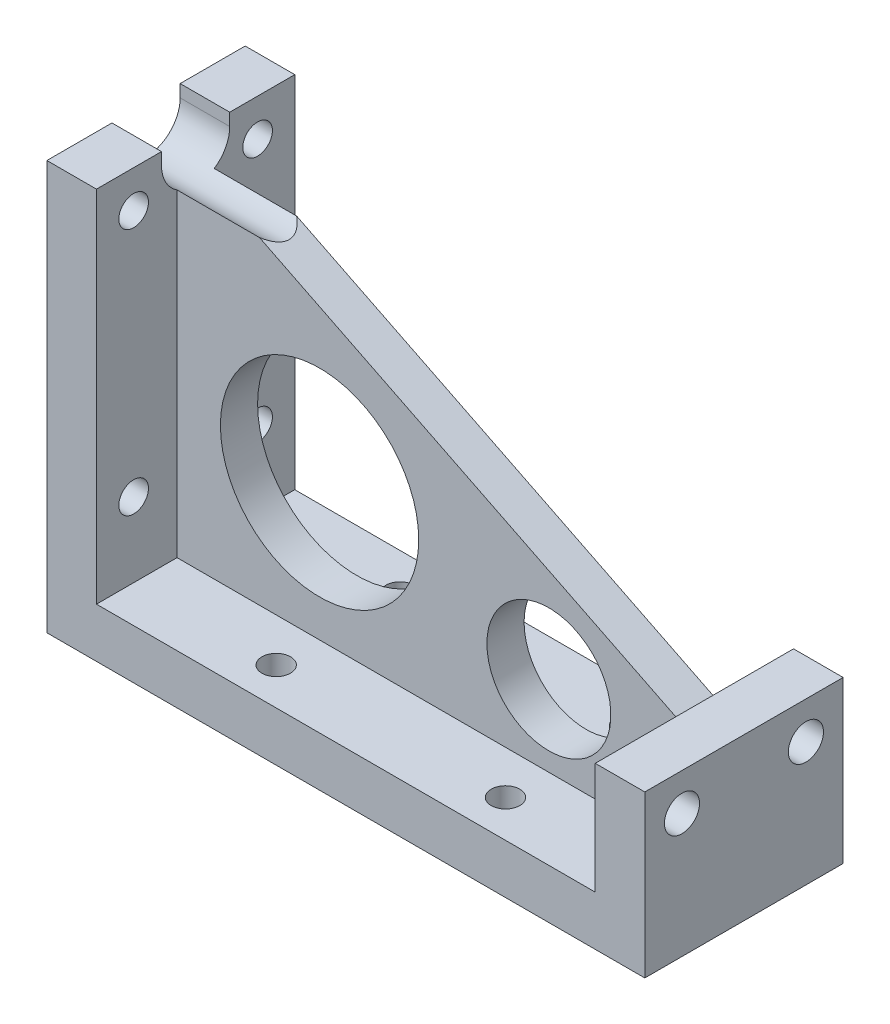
ISO-10303-21;
HEADER;
FILE_DESCRIPTION(('STEP AP214'),'2;1');
FILE_NAME('part.step','',(''),(''),'','','');
FILE_SCHEMA(('AUTOMOTIVE_DESIGN { 1 0 10303 214 1 1 1 1 }'));
ENDSEC;
DATA;
#1=APPLICATION_CONTEXT('core data for automotive mechanical design processes');
#2=APPLICATION_PROTOCOL_DEFINITION('international standard','automotive_design',2000,#1);
#3=PRODUCT_CONTEXT('',#1,'mechanical');
#4=PRODUCT('Part','Part','',(#3));
#5=PRODUCT_RELATED_PRODUCT_CATEGORY('part','',(#4));
#6=PRODUCT_DEFINITION_FORMATION('','',#4);
#7=PRODUCT_DEFINITION_CONTEXT('part definition',#1,'design');
#8=PRODUCT_DEFINITION('design','',#6,#7);
#9=PRODUCT_DEFINITION_SHAPE('','',#8);
#10=(LENGTH_UNIT() NAMED_UNIT(*) SI_UNIT(.MILLI.,.METRE.));
#11=(NAMED_UNIT(*) PLANE_ANGLE_UNIT() SI_UNIT($,.RADIAN.));
#12=(NAMED_UNIT(*) SI_UNIT($,.STERADIAN.) SOLID_ANGLE_UNIT());
#13=UNCERTAINTY_MEASURE_WITH_UNIT(LENGTH_MEASURE(1.E-05),#10,'distance_accuracy_value','');
#14=(GEOMETRIC_REPRESENTATION_CONTEXT(3) GLOBAL_UNCERTAINTY_ASSIGNED_CONTEXT((#13)) GLOBAL_UNIT_ASSIGNED_CONTEXT((#10,
#11,#12)) REPRESENTATION_CONTEXT('',''));
#15=CARTESIAN_POINT('',(0.,0.,0.));
#16=DIRECTION('',(0.,0.,1.));
#17=DIRECTION('',(1.,0.,0.));
#18=AXIS2_PLACEMENT_3D('',#15,#16,#17);
#19=CARTESIAN_POINT('',(0.,52.3875,12.7));
#20=DIRECTION('',(0.,-1.,0.));
#21=DIRECTION('',(0.,0.,-1.));
#22=AXIS2_PLACEMENT_3D('',#19,#20,#21);
#23=PLANE('',#22);
#24=DIRECTION('',(0.,0.,-1.));
#25=VECTOR('',#24,1.);
#26=CARTESIAN_POINT('',(0.,52.3875,12.7));
#27=LINE('',#26,#25);
#28=CARTESIAN_POINT('',(0.,52.3875,-4.3688));
#29=VERTEX_POINT('',#28);
#30=CARTESIAN_POINT('',(0.,52.3875,-12.7));
#31=VERTEX_POINT('',#30);
#32=EDGE_CURVE('E203',#29,#31,#27,.T.);
#33=ORIENTED_EDGE('',*,*,#32,.F.);
#34=DIRECTION('',(-1.,0.,0.));
#35=VECTOR('',#34,1.);
#36=CARTESIAN_POINT('',(76.581,52.3875,-4.3688));
#37=LINE('',#36,#35);
#38=CARTESIAN_POINT('',(6.35000000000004,52.3875,-4.3688));
#39=VERTEX_POINT('',#38);
#40=EDGE_CURVE('E382',#39,#29,#37,.T.);
#41=ORIENTED_EDGE('',*,*,#40,.F.);
#42=DIRECTION('',(0.,0.,-1.));
#43=VECTOR('',#42,1.);
#44=CARTESIAN_POINT('',(6.35,52.3875,12.7));
#45=LINE('',#44,#43);
#46=CARTESIAN_POINT('',(6.35,52.3875,-12.7));
#47=VERTEX_POINT('',#46);
#48=EDGE_CURVE('E98',#39,#47,#45,.T.);
#49=ORIENTED_EDGE('',*,*,#48,.T.);
#50=DIRECTION('',(-1.,0.,0.));
#51=VECTOR('',#50,1.);
#52=CARTESIAN_POINT('',(0.,52.3875,-12.7));
#53=LINE('',#52,#51);
#54=EDGE_CURVE('E161',#47,#31,#53,.T.);
#55=ORIENTED_EDGE('',*,*,#54,.T.);
#56=EDGE_LOOP('',(#33,#41,#49,#55));
#57=FACE_BOUND('',#56,.T.);
#58=ADVANCED_FACE('F40',(#57),#23,.F.);
#59=CARTESIAN_POINT('',(70.231,20.6375,12.7));
#60=DIRECTION('',(1.,0.,0.));
#61=DIRECTION('',(0.,0.,-1.));
#62=AXIS2_PLACEMENT_3D('',#59,#60,#61);
#63=PLANE('',#62);
#64=CARTESIAN_POINT('',(70.231,15.875,7.93750000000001));
#65=DIRECTION('',(1.,0.,0.));
#66=DIRECTION('',(0.,0.,-1.));
#67=AXIS2_PLACEMENT_3D('',#64,#65,#66);
#68=CIRCLE('',#67,2.2479);
#69=CARTESIAN_POINT('',(70.231,15.875,5.68960000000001));
#70=VERTEX_POINT('',#69);
#71=EDGE_CURVE('E269',#70,#70,#68,.T.);
#72=ORIENTED_EDGE('',*,*,#71,.T.);
#73=EDGE_LOOP('',(#72));
#74=FACE_BOUND('',#73,.T.);
#75=DIRECTION('',(0.,1.,0.));
#76=VECTOR('',#75,1.);
#77=CARTESIAN_POINT('',(70.231,6.35,2.38125));
#78=LINE('',#77,#76);
#79=CARTESIAN_POINT('',(70.231,6.35,2.38125));
#80=VERTEX_POINT('',#79);
#81=CARTESIAN_POINT('',(70.231,20.6375,2.38125));
#82=VERTEX_POINT('',#81);
#83=EDGE_CURVE('E144',#80,#82,#78,.T.);
#84=ORIENTED_EDGE('',*,*,#83,.F.);
#85=DIRECTION('',(0.,0.,-1.));
#86=VECTOR('',#85,1.);
#87=CARTESIAN_POINT('',(70.231,6.35,12.7));
#88=LINE('',#87,#86);
#89=CARTESIAN_POINT('',(70.231,6.35,12.7));
#90=VERTEX_POINT('',#89);
#91=EDGE_CURVE('E140',#90,#80,#88,.T.);
#92=ORIENTED_EDGE('',*,*,#91,.F.);
#93=DIRECTION('',(0.,-1.,0.));
#94=VECTOR('',#93,1.);
#95=CARTESIAN_POINT('',(70.231,20.6375,12.7));
#96=LINE('',#95,#94);
#97=CARTESIAN_POINT('',(70.231,20.6375,12.7));
#98=VERTEX_POINT('',#97);
#99=EDGE_CURVE('E125',#98,#90,#96,.T.);
#100=ORIENTED_EDGE('',*,*,#99,.F.);
#101=DIRECTION('',(0.,0.,-1.));
#102=VECTOR('',#101,1.);
#103=CARTESIAN_POINT('',(70.231,20.6375,12.7));
#104=LINE('',#103,#102);
#105=EDGE_CURVE('E190',#98,#82,#104,.T.);
#106=ORIENTED_EDGE('',*,*,#105,.T.);
#107=EDGE_LOOP('',(#84,#92,#100,#106));
#108=FACE_BOUND('',#107,.T.);
#109=ADVANCED_FACE('F141',(#74,#108),#63,.F.);
#110=CARTESIAN_POINT('',(6.35000000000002,6.34999999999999,12.7));
#111=DIRECTION('',(0.,-1.,0.));
#112=DIRECTION('',(1.,0.,0.));
#113=AXIS2_PLACEMENT_3D('',#110,#111,#112);
#114=PLANE('',#113);
#115=CARTESIAN_POINT('',(53.975,6.35,7.9375));
#116=DIRECTION('',(0.,1.,0.));
#117=DIRECTION('',(0.,0.,1.));
#118=AXIS2_PLACEMENT_3D('',#115,#116,#117);
#119=CIRCLE('',#118,1.82879999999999);
#120=CARTESIAN_POINT('',(53.975,6.35,9.76629999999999));
#121=VERTEX_POINT('',#120);
#122=EDGE_CURVE('E423',#121,#121,#119,.T.);
#123=ORIENTED_EDGE('',*,*,#122,.F.);
#124=EDGE_LOOP('',(#123));
#125=FACE_BOUND('',#124,.T.);
#126=CARTESIAN_POINT('',(24.60625,6.35,7.9375));
#127=DIRECTION('',(0.,1.,0.));
#128=DIRECTION('',(0.,0.,1.));
#129=AXIS2_PLACEMENT_3D('',#126,#127,#128);
#130=CIRCLE('',#129,1.82879999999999);
#131=CARTESIAN_POINT('',(24.60625,6.35,9.76629999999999));
#132=VERTEX_POINT('',#131);
#133=EDGE_CURVE('E417',#132,#132,#130,.T.);
#134=ORIENTED_EDGE('',*,*,#133,.F.);
#135=EDGE_LOOP('',(#134));
#136=FACE_BOUND('',#135,.T.);
#137=DIRECTION('',(1.,0.,0.));
#138=VECTOR('',#137,1.);
#139=CARTESIAN_POINT('',(53.975,6.35,2.38125));
#140=LINE('',#139,#138);
#141=CARTESIAN_POINT('',(6.35000000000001,6.34999999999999,2.38125));
#142=VERTEX_POINT('',#141);
#143=EDGE_CURVE('E235',#142,#80,#140,.T.);
#144=ORIENTED_EDGE('',*,*,#143,.F.);
#145=DIRECTION('',(0.,0.,-1.));
#146=VECTOR('',#145,1.);
#147=CARTESIAN_POINT('',(6.35000000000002,6.34999999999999,12.7));
#148=LINE('',#147,#146);
#149=CARTESIAN_POINT('',(6.35000000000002,6.34999999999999,12.7));
#150=VERTEX_POINT('',#149);
#151=EDGE_CURVE('E152',#150,#142,#148,.T.);
#152=ORIENTED_EDGE('',*,*,#151,.F.);
#153=DIRECTION('',(-1.,0.,0.));
#154=VECTOR('',#153,1.);
#155=CARTESIAN_POINT('',(53.975,6.35,12.7));
#156=LINE('',#155,#154);
#157=EDGE_CURVE('E129',#90,#150,#156,.T.);
#158=ORIENTED_EDGE('',*,*,#157,.F.);
#159=ORIENTED_EDGE('',*,*,#91,.T.);
#160=EDGE_LOOP('',(#144,#152,#158,#159));
#161=FACE_BOUND('',#160,.T.);
#162=ADVANCED_FACE('F150',(#125,#136,#161),#114,.F.);
#163=CARTESIAN_POINT('',(6.35,52.3875,12.7));
#164=DIRECTION('',(-1.,0.,0.));
#165=DIRECTION('',(0.,-1.,0.));
#166=AXIS2_PLACEMENT_3D('',#163,#164,#165);
#167=PLANE('',#166);
#168=CARTESIAN_POINT('',(6.35000000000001,47.625,7.93750000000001));
#169=DIRECTION('',(1.,0.,0.));
#170=DIRECTION('',(0.,0.,-1.));
#171=AXIS2_PLACEMENT_3D('',#168,#169,#170);
#172=CIRCLE('',#171,1.89865);
#173=CARTESIAN_POINT('',(6.35000000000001,47.625,6.03885000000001));
#174=VERTEX_POINT('',#173);
#175=EDGE_CURVE('E275',#174,#174,#172,.T.);
#176=ORIENTED_EDGE('',*,*,#175,.F.);
#177=EDGE_LOOP('',(#176));
#178=FACE_BOUND('',#177,.T.);
#179=CARTESIAN_POINT('',(6.35000000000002,15.875,7.93750000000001));
#180=DIRECTION('',(1.,0.,0.));
#181=DIRECTION('',(0.,0.,-1.));
#182=AXIS2_PLACEMENT_3D('',#179,#180,#181);
#183=CIRCLE('',#182,1.89865);
#184=CARTESIAN_POINT('',(6.35000000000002,15.875,6.03885000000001));
#185=VERTEX_POINT('',#184);
#186=EDGE_CURVE('E208',#185,#185,#183,.T.);
#187=ORIENTED_EDGE('',*,*,#186,.F.);
#188=EDGE_LOOP('',(#187));
#189=FACE_BOUND('',#188,.T.);
#190=CARTESIAN_POINT('',(6.35000000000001,50.8,0.));
#191=DIRECTION('',(-1.,0.,0.));
#192=DIRECTION('',(0.,-1.,0.));
#193=AXIS2_PLACEMENT_3D('',#190,#191,#192);
#194=CIRCLE('',#193,4.3688);
#195=CARTESIAN_POINT('',(6.35000000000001,47.1372057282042,2.38125));
#196=VERTEX_POINT('',#195);
#197=CARTESIAN_POINT('',(6.35000000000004,50.8,4.3688));
#198=VERTEX_POINT('',#197);
#199=EDGE_CURVE('E368',#196,#198,#194,.T.);
#200=ORIENTED_EDGE('',*,*,#199,.T.);
#201=DIRECTION('',(0.,1.,0.));
#202=VECTOR('',#201,1.);
#203=CARTESIAN_POINT('',(6.35,52.3875,4.3688));
#204=LINE('',#203,#202);
#205=CARTESIAN_POINT('',(6.35000000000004,52.3875,4.3688));
#206=VERTEX_POINT('',#205);
#207=EDGE_CURVE('E366',#198,#206,#204,.T.);
#208=ORIENTED_EDGE('',*,*,#207,.T.);
#209=CARTESIAN_POINT('',(6.35,52.3875,12.7));
#210=VERTEX_POINT('',#209);
#211=EDGE_CURVE('E185',#210,#206,#45,.T.);
#212=ORIENTED_EDGE('',*,*,#211,.F.);
#213=DIRECTION('',(0.,1.,0.));
#214=VECTOR('',#213,1.);
#215=CARTESIAN_POINT('',(6.35,52.3875,12.7));
#216=LINE('',#215,#214);
#217=EDGE_CURVE('E64',#150,#210,#216,.T.);
#218=ORIENTED_EDGE('',*,*,#217,.F.);
#219=ORIENTED_EDGE('',*,*,#151,.T.);
#220=DIRECTION('',(0.,-1.,0.));
#221=VECTOR('',#220,1.);
#222=CARTESIAN_POINT('',(6.35000000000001,6.34999999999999,2.38125));
#223=LINE('',#222,#221);
#224=EDGE_CURVE('E231',#196,#142,#223,.T.);
#225=ORIENTED_EDGE('',*,*,#224,.F.);
#226=EDGE_LOOP('',(#200,#208,#212,#218,#219,#225));
#227=FACE_BOUND('',#226,.T.);
#228=ADVANCED_FACE('F342',(#178,#189,#227),#167,.F.);
#229=ORIENTED_EDGE('',*,*,#211,.T.);
#230=DIRECTION('',(-1.,0.,0.));
#231=VECTOR('',#230,1.);
#232=CARTESIAN_POINT('',(76.581,52.3875,4.3688));
#233=LINE('',#232,#231);
#234=CARTESIAN_POINT('',(0.,52.3875,4.3688));
#235=VERTEX_POINT('',#234);
#236=EDGE_CURVE('E359',#206,#235,#233,.T.);
#237=ORIENTED_EDGE('',*,*,#236,.T.);
#238=CARTESIAN_POINT('',(0.,52.3875,12.7));
#239=VERTEX_POINT('',#238);
#240=EDGE_CURVE('E204',#239,#235,#27,.T.);
#241=ORIENTED_EDGE('',*,*,#240,.F.);
#242=DIRECTION('',(-1.,0.,0.));
#243=VECTOR('',#242,1.);
#244=CARTESIAN_POINT('',(0.,52.3875,12.7));
#245=LINE('',#244,#243);
#246=EDGE_CURVE('E184',#210,#239,#245,.T.);
#247=ORIENTED_EDGE('',*,*,#246,.F.);
#248=EDGE_LOOP('',(#229,#237,#241,#247));
#249=FACE_BOUND('',#248,.T.);
#250=ADVANCED_FACE('F42',(#249),#23,.F.);
#251=CARTESIAN_POINT('',(0.,52.3875,12.7));
#252=DIRECTION('',(1.,0.,0.));
#253=DIRECTION('',(0.,1.,0.));
#254=AXIS2_PLACEMENT_3D('',#251,#252,#253);
#255=PLANE('',#254);
#256=CARTESIAN_POINT('',(0.,47.625,7.93750000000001));
#257=DIRECTION('',(1.,0.,0.));
#258=DIRECTION('',(0.,1.,0.));
#259=AXIS2_PLACEMENT_3D('',#256,#257,#258);
#260=CIRCLE('',#259,1.89865);
#261=CARTESIAN_POINT('',(0.,49.52365,7.93750000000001));
#262=VERTEX_POINT('',#261);
#263=EDGE_CURVE('E284',#262,#262,#260,.T.);
#264=ORIENTED_EDGE('',*,*,#263,.T.);
#265=EDGE_LOOP('',(#264));
#266=FACE_BOUND('',#265,.T.);
#267=CARTESIAN_POINT('',(0.,47.625,-7.93749999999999));
#268=DIRECTION('',(1.,0.,0.));
#269=DIRECTION('',(0.,1.,0.));
#270=AXIS2_PLACEMENT_3D('',#267,#268,#269);
#271=CIRCLE('',#270,1.89865);
#272=CARTESIAN_POINT('',(0.,49.52365,-7.93749999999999));
#273=VERTEX_POINT('',#272);
#274=EDGE_CURVE('E290',#273,#273,#271,.T.);
#275=ORIENTED_EDGE('',*,*,#274,.T.);
#276=EDGE_LOOP('',(#275));
#277=FACE_BOUND('',#276,.T.);
#278=CARTESIAN_POINT('',(0.,15.875,-7.93749999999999));
#279=DIRECTION('',(1.,0.,0.));
#280=DIRECTION('',(0.,1.,0.));
#281=AXIS2_PLACEMENT_3D('',#278,#279,#280);
#282=CIRCLE('',#281,1.89865);
#283=CARTESIAN_POINT('',(0.,17.77365,-7.93749999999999));
#284=VERTEX_POINT('',#283);
#285=EDGE_CURVE('E206',#284,#284,#282,.T.);
#286=ORIENTED_EDGE('',*,*,#285,.T.);
#287=EDGE_LOOP('',(#286));
#288=FACE_BOUND('',#287,.T.);
#289=CARTESIAN_POINT('',(0.,15.875,7.93750000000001));
#290=DIRECTION('',(1.,0.,0.));
#291=DIRECTION('',(0.,1.,0.));
#292=AXIS2_PLACEMENT_3D('',#289,#290,#291);
#293=CIRCLE('',#292,1.89865);
#294=CARTESIAN_POINT('',(0.,17.77365,7.93750000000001));
#295=VERTEX_POINT('',#294);
#296=EDGE_CURVE('E298',#295,#295,#293,.T.);
#297=ORIENTED_EDGE('',*,*,#296,.T.);
#298=EDGE_LOOP('',(#297));
#299=FACE_BOUND('',#298,.T.);
#300=CARTESIAN_POINT('',(0.,50.8,0.));
#301=DIRECTION('',(-1.,0.,0.));
#302=DIRECTION('',(0.,1.,0.));
#303=AXIS2_PLACEMENT_3D('',#300,#301,#302);
#304=CIRCLE('',#303,4.3688);
#305=CARTESIAN_POINT('',(0.,50.8,-4.3688));
#306=VERTEX_POINT('',#305);
#307=CARTESIAN_POINT('',(0.,50.8,4.3688));
#308=VERTEX_POINT('',#307);
#309=EDGE_CURVE('E394',#306,#308,#304,.T.);
#310=ORIENTED_EDGE('',*,*,#309,.F.);
#311=DIRECTION('',(0.,-1.,0.));
#312=VECTOR('',#311,1.);
#313=CARTESIAN_POINT('',(0.,52.3875,-4.3688));
#314=LINE('',#313,#312);
#315=EDGE_CURVE('E397',#29,#306,#314,.T.);
#316=ORIENTED_EDGE('',*,*,#315,.F.);
#317=ORIENTED_EDGE('',*,*,#32,.T.);
#318=DIRECTION('',(0.,-1.,0.));
#319=VECTOR('',#318,1.);
#320=CARTESIAN_POINT('',(0.,52.3875,-12.7));
#321=LINE('',#320,#319);
#322=CARTESIAN_POINT('',(0.,0.,-12.7));
#323=VERTEX_POINT('',#322);
#324=EDGE_CURVE('E163',#31,#323,#321,.T.);
#325=ORIENTED_EDGE('',*,*,#324,.T.);
#326=DIRECTION('',(0.,0.,-1.));
#327=VECTOR('',#326,1.);
#328=CARTESIAN_POINT('',(0.,0.,12.7));
#329=LINE('',#328,#327);
#330=CARTESIAN_POINT('',(0.,0.,12.7));
#331=VERTEX_POINT('',#330);
#332=EDGE_CURVE('E200',#331,#323,#329,.T.);
#333=ORIENTED_EDGE('',*,*,#332,.F.);
#334=DIRECTION('',(0.,-1.,0.));
#335=VECTOR('',#334,1.);
#336=CARTESIAN_POINT('',(0.,52.3875,12.7));
#337=LINE('',#336,#335);
#338=EDGE_CURVE('E107',#239,#331,#337,.T.);
#339=ORIENTED_EDGE('',*,*,#338,.F.);
#340=ORIENTED_EDGE('',*,*,#240,.T.);
#341=DIRECTION('',(0.,1.,0.));
#342=VECTOR('',#341,1.);
#343=CARTESIAN_POINT('',(0.,52.3875,4.3688));
#344=LINE('',#343,#342);
#345=EDGE_CURVE('E387',#308,#235,#344,.T.);
#346=ORIENTED_EDGE('',*,*,#345,.F.);
#347=EDGE_LOOP('',(#310,#316,#317,#325,#333,#339,#340,#346));
#348=FACE_BOUND('',#347,.T.);
#349=ADVANCED_FACE('F341',(#266,#277,#288,#299,#348),#255,.F.);
#350=CARTESIAN_POINT('',(53.975,0.,12.7));
#351=DIRECTION('',(0.,1.,0.));
#352=DIRECTION('',(-1.,0.,0.));
#353=AXIS2_PLACEMENT_3D('',#350,#351,#352);
#354=PLANE('',#353);
#355=CARTESIAN_POINT('',(53.975,0.,7.9375));
#356=DIRECTION('',(0.,1.,0.));
#357=DIRECTION('',(0.,0.,1.));
#358=AXIS2_PLACEMENT_3D('',#355,#356,#357);
#359=CIRCLE('',#358,1.8288);
#360=CARTESIAN_POINT('',(53.975,0.,9.7663));
#361=VERTEX_POINT('',#360);
#362=EDGE_CURVE('E420',#361,#361,#359,.T.);
#363=ORIENTED_EDGE('',*,*,#362,.T.);
#364=EDGE_LOOP('',(#363));
#365=FACE_BOUND('',#364,.T.);
#366=CARTESIAN_POINT('',(24.60625,0.,7.9375));
#367=DIRECTION('',(0.,1.,0.));
#368=DIRECTION('',(0.,0.,1.));
#369=AXIS2_PLACEMENT_3D('',#366,#367,#368);
#370=CIRCLE('',#369,1.8288);
#371=CARTESIAN_POINT('',(24.60625,0.,9.7663));
#372=VERTEX_POINT('',#371);
#373=EDGE_CURVE('E414',#372,#372,#370,.T.);
#374=ORIENTED_EDGE('',*,*,#373,.T.);
#375=EDGE_LOOP('',(#374));
#376=FACE_BOUND('',#375,.T.);
#377=CARTESIAN_POINT('',(24.60625,0.,-7.9375));
#378=DIRECTION('',(0.,1.,0.));
#379=DIRECTION('',(0.,0.,1.));
#380=AXIS2_PLACEMENT_3D('',#377,#378,#379);
#381=CIRCLE('',#380,1.8288);
#382=CARTESIAN_POINT('',(24.60625,0.,-6.1087));
#383=VERTEX_POINT('',#382);
#384=EDGE_CURVE('E408',#383,#383,#381,.T.);
#385=ORIENTED_EDGE('',*,*,#384,.T.);
#386=EDGE_LOOP('',(#385));
#387=FACE_BOUND('',#386,.T.);
#388=CARTESIAN_POINT('',(53.975,0.,-7.9375));
#389=DIRECTION('',(0.,1.,0.));
#390=DIRECTION('',(0.,0.,1.));
#391=AXIS2_PLACEMENT_3D('',#388,#389,#390);
#392=CIRCLE('',#391,1.8288);
#393=CARTESIAN_POINT('',(53.975,0.,-6.1087));
#394=VERTEX_POINT('',#393);
#395=EDGE_CURVE('E400',#394,#394,#392,.T.);
#396=ORIENTED_EDGE('',*,*,#395,.T.);
#397=EDGE_LOOP('',(#396));
#398=FACE_BOUND('',#397,.T.);
#399=DIRECTION('',(1.,0.,0.));
#400=VECTOR('',#399,1.);
#401=CARTESIAN_POINT('',(53.975,0.,-12.7));
#402=LINE('',#401,#400);
#403=CARTESIAN_POINT('',(76.581,0.,-12.7));
#404=VERTEX_POINT('',#403);
#405=EDGE_CURVE('E167',#323,#404,#402,.T.);
#406=ORIENTED_EDGE('',*,*,#405,.T.);
#407=DIRECTION('',(0.,0.,-1.));
#408=VECTOR('',#407,1.);
#409=CARTESIAN_POINT('',(76.581,0.,12.7));
#410=LINE('',#409,#408);
#411=CARTESIAN_POINT('',(76.581,0.,12.7));
#412=VERTEX_POINT('',#411);
#413=EDGE_CURVE('E197',#412,#404,#410,.T.);
#414=ORIENTED_EDGE('',*,*,#413,.F.);
#415=DIRECTION('',(1.,0.,0.));
#416=VECTOR('',#415,1.);
#417=CARTESIAN_POINT('',(0.,0.,12.7));
#418=LINE('',#417,#416);
#419=EDGE_CURVE('E260',#331,#412,#418,.T.);
#420=ORIENTED_EDGE('',*,*,#419,.F.);
#421=ORIENTED_EDGE('',*,*,#332,.T.);
#422=EDGE_LOOP('',(#406,#414,#420,#421));
#423=FACE_BOUND('',#422,.T.);
#424=ADVANCED_FACE('F348',(#365,#376,#387,#398,#423),#354,.F.);
#425=CARTESIAN_POINT('',(76.581,20.6375,12.7));
#426=DIRECTION('',(-1.,0.,0.));
#427=DIRECTION('',(0.,0.,1.));
#428=AXIS2_PLACEMENT_3D('',#425,#426,#427);
#429=PLANE('',#428);
#430=CARTESIAN_POINT('',(76.581,15.875,-7.93749999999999));
#431=DIRECTION('',(1.,0.,0.));
#432=DIRECTION('',(0.,0.,-1.));
#433=AXIS2_PLACEMENT_3D('',#430,#431,#432);
#434=CIRCLE('',#433,2.2479);
#435=CARTESIAN_POINT('',(76.581,15.875,-10.1854));
#436=VERTEX_POINT('',#435);
#437=EDGE_CURVE('E278',#436,#436,#434,.T.);
#438=ORIENTED_EDGE('',*,*,#437,.F.);
#439=EDGE_LOOP('',(#438));
#440=FACE_BOUND('',#439,.T.);
#441=CARTESIAN_POINT('',(76.581,15.875,7.93750000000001));
#442=DIRECTION('',(1.,0.,0.));
#443=DIRECTION('',(0.,0.,-1.));
#444=AXIS2_PLACEMENT_3D('',#441,#442,#443);
#445=CIRCLE('',#444,2.2479);
#446=CARTESIAN_POINT('',(76.581,15.875,5.68960000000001));
#447=VERTEX_POINT('',#446);
#448=EDGE_CURVE('E267',#447,#447,#445,.T.);
#449=ORIENTED_EDGE('',*,*,#448,.F.);
#450=EDGE_LOOP('',(#449));
#451=FACE_BOUND('',#450,.T.);
#452=DIRECTION('',(0.,1.,0.));
#453=VECTOR('',#452,1.);
#454=CARTESIAN_POINT('',(76.581,20.6375,-12.7));
#455=LINE('',#454,#453);
#456=CARTESIAN_POINT('',(76.581,20.6375,-12.7));
#457=VERTEX_POINT('',#456);
#458=EDGE_CURVE('E170',#404,#457,#455,.T.);
#459=ORIENTED_EDGE('',*,*,#458,.T.);
#460=DIRECTION('',(0.,0.,-1.));
#461=VECTOR('',#460,1.);
#462=CARTESIAN_POINT('',(76.581,20.6375,12.7));
#463=LINE('',#462,#461);
#464=CARTESIAN_POINT('',(76.581,20.6375,12.7));
#465=VERTEX_POINT('',#464);
#466=EDGE_CURVE('E193',#465,#457,#463,.T.);
#467=ORIENTED_EDGE('',*,*,#466,.F.);
#468=DIRECTION('',(0.,1.,0.));
#469=VECTOR('',#468,1.);
#470=CARTESIAN_POINT('',(76.581,20.6375,12.7));
#471=LINE('',#470,#469);
#472=EDGE_CURVE('E262',#412,#465,#471,.T.);
#473=ORIENTED_EDGE('',*,*,#472,.F.);
#474=ORIENTED_EDGE('',*,*,#413,.T.);
#475=EDGE_LOOP('',(#459,#467,#473,#474));
#476=FACE_BOUND('',#475,.T.);
#477=ADVANCED_FACE('F548',(#440,#451,#476),#429,.F.);
#478=CARTESIAN_POINT('',(76.581,20.6375,12.7));
#479=DIRECTION('',(0.,-1.,0.));
#480=DIRECTION('',(0.,0.,-1.));
#481=AXIS2_PLACEMENT_3D('',#478,#479,#480);
#482=PLANE('',#481);
#483=DIRECTION('',(-1.,0.,0.));
#484=VECTOR('',#483,1.);
#485=CARTESIAN_POINT('',(76.581,20.6375,-12.7));
#486=LINE('',#485,#484);
#487=CARTESIAN_POINT('',(70.231,20.6375,-12.7));
#488=VERTEX_POINT('',#487);
#489=EDGE_CURVE('E172',#457,#488,#486,.T.);
#490=ORIENTED_EDGE('',*,*,#489,.T.);
#491=CARTESIAN_POINT('',(70.231,20.6375,-2.38125));
#492=VERTEX_POINT('',#491);
#493=EDGE_CURVE('E147',#492,#488,#104,.T.);
#494=ORIENTED_EDGE('',*,*,#493,.F.);
#495=DIRECTION('',(0.,0.,-1.));
#496=VECTOR('',#495,1.);
#497=CARTESIAN_POINT('',(70.231,20.6375,2.38125));
#498=LINE('',#497,#496);
#499=EDGE_CURVE('E164',#82,#492,#498,.T.);
#500=ORIENTED_EDGE('',*,*,#499,.F.);
#501=ORIENTED_EDGE('',*,*,#105,.F.);
#502=DIRECTION('',(-1.,0.,0.));
#503=VECTOR('',#502,1.);
#504=CARTESIAN_POINT('',(76.581,20.6375,12.7));
#505=LINE('',#504,#503);
#506=EDGE_CURVE('E132',#465,#98,#505,.T.);
#507=ORIENTED_EDGE('',*,*,#506,.F.);
#508=ORIENTED_EDGE('',*,*,#466,.T.);
#509=EDGE_LOOP('',(#490,#494,#500,#501,#507,#508));
#510=FACE_BOUND('',#509,.T.);
#511=ADVANCED_FACE('F529',(#510),#482,.F.);
#512=CARTESIAN_POINT('',(70.231,15.875,-7.93749999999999));
#513=DIRECTION('',(1.,0.,0.));
#514=DIRECTION('',(0.,0.,-1.));
#515=AXIS2_PLACEMENT_3D('',#512,#513,#514);
#516=CIRCLE('',#515,2.2479);
#517=CARTESIAN_POINT('',(70.231,15.875,-10.1854));
#518=VERTEX_POINT('',#517);
#519=EDGE_CURVE('E270',#518,#518,#516,.T.);
#520=ORIENTED_EDGE('',*,*,#519,.T.);
#521=EDGE_LOOP('',(#520));
#522=FACE_BOUND('',#521,.T.);
#523=CARTESIAN_POINT('',(70.231,6.35,-2.38125));
#524=VERTEX_POINT('',#523);
#525=CARTESIAN_POINT('',(70.231,6.35,-12.7));
#526=VERTEX_POINT('',#525);
#527=EDGE_CURVE('E148',#524,#526,#88,.T.);
#528=ORIENTED_EDGE('',*,*,#527,.F.);
#529=DIRECTION('',(0.,1.,0.));
#530=VECTOR('',#529,1.);
#531=CARTESIAN_POINT('',(70.231,6.35,-2.38125));
#532=LINE('',#531,#530);
#533=EDGE_CURVE('E232',#524,#492,#532,.T.);
#534=ORIENTED_EDGE('',*,*,#533,.T.);
#535=ORIENTED_EDGE('',*,*,#493,.T.);
#536=DIRECTION('',(0.,-1.,0.));
#537=VECTOR('',#536,1.);
#538=CARTESIAN_POINT('',(70.231,20.6375,-12.7));
#539=LINE('',#538,#537);
#540=EDGE_CURVE('E175',#488,#526,#539,.T.);
#541=ORIENTED_EDGE('',*,*,#540,.T.);
#542=EDGE_LOOP('',(#528,#534,#535,#541));
#543=FACE_BOUND('',#542,.T.);
#544=ADVANCED_FACE('F338',(#522,#543),#63,.F.);
#545=CARTESIAN_POINT('',(24.60625,6.35,-7.9375));
#546=DIRECTION('',(0.,1.,0.));
#547=DIRECTION('',(0.,0.,1.));
#548=AXIS2_PLACEMENT_3D('',#545,#546,#547);
#549=CIRCLE('',#548,1.82879999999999);
#550=CARTESIAN_POINT('',(24.60625,6.35,-6.10870000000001));
#551=VERTEX_POINT('',#550);
#552=EDGE_CURVE('E411',#551,#551,#549,.T.);
#553=ORIENTED_EDGE('',*,*,#552,.F.);
#554=EDGE_LOOP('',(#553));
#555=FACE_BOUND('',#554,.T.);
#556=CARTESIAN_POINT('',(53.975,6.35,-7.9375));
#557=DIRECTION('',(0.,1.,0.));
#558=DIRECTION('',(0.,0.,1.));
#559=AXIS2_PLACEMENT_3D('',#556,#557,#558);
#560=CIRCLE('',#559,1.82879999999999);
#561=CARTESIAN_POINT('',(53.975,6.35,-6.10870000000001));
#562=VERTEX_POINT('',#561);
#563=EDGE_CURVE('E404',#562,#562,#560,.T.);
#564=ORIENTED_EDGE('',*,*,#563,.F.);
#565=EDGE_LOOP('',(#564));
#566=FACE_BOUND('',#565,.T.);
#567=CARTESIAN_POINT('',(6.35000000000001,6.34999999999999,-2.38125));
#568=VERTEX_POINT('',#567);
#569=CARTESIAN_POINT('',(6.35000000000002,6.34999999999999,-12.7));
#570=VERTEX_POINT('',#569);
#571=EDGE_CURVE('E188',#568,#570,#148,.T.);
#572=ORIENTED_EDGE('',*,*,#571,.F.);
#573=DIRECTION('',(1.,0.,0.));
#574=VECTOR('',#573,1.);
#575=CARTESIAN_POINT('',(53.975,6.35,-2.38125));
#576=LINE('',#575,#574);
#577=EDGE_CURVE('E238',#568,#524,#576,.T.);
#578=ORIENTED_EDGE('',*,*,#577,.T.);
#579=ORIENTED_EDGE('',*,*,#527,.T.);
#580=DIRECTION('',(-1.,0.,0.));
#581=VECTOR('',#580,1.);
#582=CARTESIAN_POINT('',(6.35000000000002,6.34999999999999,-12.7));
#583=LINE('',#582,#581);
#584=EDGE_CURVE('E178',#526,#570,#583,.T.);
#585=ORIENTED_EDGE('',*,*,#584,.T.);
#586=EDGE_LOOP('',(#572,#578,#579,#585));
#587=FACE_BOUND('',#586,.T.);
#588=ADVANCED_FACE('F433',(#555,#566,#587),#114,.F.);
#589=CARTESIAN_POINT('',(6.35000000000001,47.625,-7.93749999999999));
#590=DIRECTION('',(1.,0.,0.));
#591=DIRECTION('',(0.,0.,-1.));
#592=AXIS2_PLACEMENT_3D('',#589,#590,#591);
#593=CIRCLE('',#592,1.89865);
#594=CARTESIAN_POINT('',(6.35000000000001,47.625,-9.83614999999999));
#595=VERTEX_POINT('',#594);
#596=EDGE_CURVE('E287',#595,#595,#593,.T.);
#597=ORIENTED_EDGE('',*,*,#596,.F.);
#598=EDGE_LOOP('',(#597));
#599=FACE_BOUND('',#598,.T.);
#600=CARTESIAN_POINT('',(6.35000000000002,15.875,-7.93749999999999));
#601=DIRECTION('',(1.,0.,0.));
#602=DIRECTION('',(0.,0.,-1.));
#603=AXIS2_PLACEMENT_3D('',#600,#601,#602);
#604=CIRCLE('',#603,1.89865);
#605=CARTESIAN_POINT('',(6.35000000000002,15.875,-9.83614999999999));
#606=VERTEX_POINT('',#605);
#607=EDGE_CURVE('E209',#606,#606,#604,.T.);
#608=ORIENTED_EDGE('',*,*,#607,.F.);
#609=EDGE_LOOP('',(#608));
#610=FACE_BOUND('',#609,.T.);
#611=ORIENTED_EDGE('',*,*,#48,.F.);
#612=DIRECTION('',(0.,-1.,0.));
#613=VECTOR('',#612,1.);
#614=CARTESIAN_POINT('',(6.35,52.3875,-4.3688));
#615=LINE('',#614,#613);
#616=CARTESIAN_POINT('',(6.35000000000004,50.8,-4.3688));
#617=VERTEX_POINT('',#616);
#618=EDGE_CURVE('E11',#39,#617,#615,.T.);
#619=ORIENTED_EDGE('',*,*,#618,.T.);
#620=CARTESIAN_POINT('',(6.35000000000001,50.8,0.));
#621=DIRECTION('',(-1.,0.,0.));
#622=DIRECTION('',(0.,-1.,0.));
#623=AXIS2_PLACEMENT_3D('',#620,#621,#622);
#624=CIRCLE('',#623,4.3688);
#625=CARTESIAN_POINT('',(6.35000000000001,47.1372057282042,-2.38125));
#626=VERTEX_POINT('',#625);
#627=EDGE_CURVE('E374',#617,#626,#624,.T.);
#628=ORIENTED_EDGE('',*,*,#627,.T.);
#629=DIRECTION('',(0.,-1.,0.));
#630=VECTOR('',#629,1.);
#631=CARTESIAN_POINT('',(6.35000000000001,6.34999999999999,-2.38125));
#632=LINE('',#631,#630);
#633=EDGE_CURVE('E249',#626,#568,#632,.T.);
#634=ORIENTED_EDGE('',*,*,#633,.T.);
#635=ORIENTED_EDGE('',*,*,#571,.T.);
#636=DIRECTION('',(0.,1.,0.));
#637=VECTOR('',#636,1.);
#638=CARTESIAN_POINT('',(6.35,52.3875,-12.7));
#639=LINE('',#638,#637);
#640=EDGE_CURVE('E182',#570,#47,#639,.T.);
#641=ORIENTED_EDGE('',*,*,#640,.T.);
#642=EDGE_LOOP('',(#611,#619,#628,#634,#635,#641));
#643=FACE_BOUND('',#642,.T.);
#644=ADVANCED_FACE('F352',(#599,#610,#643),#167,.F.);
#645=CARTESIAN_POINT('',(0.,0.,12.7));
#646=DIRECTION('',(0.,0.,-1.));
#647=DIRECTION('',(-1.,0.,0.));
#648=AXIS2_PLACEMENT_3D('',#645,#646,#647);
#649=PLANE('',#648);
#650=ORIENTED_EDGE('',*,*,#246,.T.);
#651=ORIENTED_EDGE('',*,*,#338,.T.);
#652=ORIENTED_EDGE('',*,*,#419,.T.);
#653=ORIENTED_EDGE('',*,*,#472,.T.);
#654=ORIENTED_EDGE('',*,*,#506,.T.);
#655=ORIENTED_EDGE('',*,*,#99,.T.);
#656=ORIENTED_EDGE('',*,*,#157,.T.);
#657=ORIENTED_EDGE('',*,*,#217,.T.);
#658=EDGE_LOOP('',(#650,#651,#652,#653,#654,#655,#656,#657));
#659=FACE_BOUND('',#658,.T.);
#660=ADVANCED_FACE('F127',(#659),#649,.F.);
#661=CARTESIAN_POINT('',(0.,0.,-12.7));
#662=DIRECTION('',(0.,0.,-1.));
#663=DIRECTION('',(-1.,0.,0.));
#664=AXIS2_PLACEMENT_3D('',#661,#662,#663);
#665=PLANE('',#664);
#666=ORIENTED_EDGE('',*,*,#54,.F.);
#667=ORIENTED_EDGE('',*,*,#640,.F.);
#668=ORIENTED_EDGE('',*,*,#584,.F.);
#669=ORIENTED_EDGE('',*,*,#540,.F.);
#670=ORIENTED_EDGE('',*,*,#489,.F.);
#671=ORIENTED_EDGE('',*,*,#458,.F.);
#672=ORIENTED_EDGE('',*,*,#405,.F.);
#673=ORIENTED_EDGE('',*,*,#324,.F.);
#674=EDGE_LOOP('',(#666,#667,#668,#669,#670,#671,#672,#673));
#675=FACE_BOUND('',#674,.T.);
#676=ADVANCED_FACE('F537',(#675),#665,.T.);
#677=CARTESIAN_POINT('',(0.,0.,2.38125));
#678=DIRECTION('',(0.,0.,-1.));
#679=DIRECTION('',(-1.,0.,0.));
#680=AXIS2_PLACEMENT_3D('',#677,#678,#679);
#681=PLANE('',#680);
#682=CARTESIAN_POINT('',(24.60625,23.8125,2.38125));
#683=DIRECTION('',(0.,0.,1.));
#684=DIRECTION('',(1.,0.,0.));
#685=AXIS2_PLACEMENT_3D('',#682,#683,#684);
#686=CIRCLE('',#685,12.7);
#687=CARTESIAN_POINT('',(11.90625,23.8125,2.38125));
#688=VERTEX_POINT('',#687);
#689=EDGE_CURVE('E250',#688,#688,#686,.T.);
#690=ORIENTED_EDGE('',*,*,#689,.F.);
#691=EDGE_LOOP('',(#690));
#692=FACE_BOUND('',#691,.T.);
#693=DIRECTION('',(-0.89549282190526,0.445075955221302,0.));
#694=VECTOR('',#693,1.);
#695=CARTESIAN_POINT('',(70.231,20.6375,2.38125));
#696=LINE('',#695,#694);
#697=CARTESIAN_POINT('',(16.9135920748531,47.1372057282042,2.38125));
#698=VERTEX_POINT('',#697);
#699=EDGE_CURVE('E216',#82,#698,#696,.T.);
#700=ORIENTED_EDGE('',*,*,#699,.T.);
#701=DIRECTION('',(-1.,0.,0.));
#702=VECTOR('',#701,1.);
#703=CARTESIAN_POINT('',(76.581,47.1372057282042,2.38125));
#704=LINE('',#703,#702);
#705=EDGE_CURVE('E55',#698,#196,#704,.T.);
#706=ORIENTED_EDGE('',*,*,#705,.T.);
#707=ORIENTED_EDGE('',*,*,#224,.T.);
#708=ORIENTED_EDGE('',*,*,#143,.T.);
#709=ORIENTED_EDGE('',*,*,#83,.T.);
#710=EDGE_LOOP('',(#700,#706,#707,#708,#709));
#711=FACE_BOUND('',#710,.T.);
#712=CARTESIAN_POINT('',(53.975,16.66875,2.38125));
#713=DIRECTION('',(0.,0.,1.));
#714=DIRECTION('',(1.,0.,0.));
#715=AXIS2_PLACEMENT_3D('',#712,#713,#714);
#716=CIRCLE('',#715,7.9375);
#717=CARTESIAN_POINT('',(46.0375,16.66875,2.38125));
#718=VERTEX_POINT('',#717);
#719=EDGE_CURVE('E303',#718,#718,#716,.T.);
#720=ORIENTED_EDGE('',*,*,#719,.F.);
#721=EDGE_LOOP('',(#720));
#722=FACE_BOUND('',#721,.T.);
#723=ADVANCED_FACE('F224',(#692,#711,#722),#681,.F.);
#724=CARTESIAN_POINT('',(0.,0.,-2.38125));
#725=DIRECTION('',(0.,0.,-1.));
#726=DIRECTION('',(-1.,0.,0.));
#727=AXIS2_PLACEMENT_3D('',#724,#725,#726);
#728=PLANE('',#727);
#729=DIRECTION('',(-1.,0.,0.));
#730=VECTOR('',#729,1.);
#731=CARTESIAN_POINT('',(76.581,47.1372057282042,-2.38125));
#732=LINE('',#731,#730);
#733=CARTESIAN_POINT('',(16.9135920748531,47.1372057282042,-2.38125));
#734=VERTEX_POINT('',#733);
#735=EDGE_CURVE('E380',#734,#626,#732,.T.);
#736=ORIENTED_EDGE('',*,*,#735,.F.);
#737=DIRECTION('',(-0.89549282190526,0.445075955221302,0.));
#738=VECTOR('',#737,1.);
#739=CARTESIAN_POINT('',(70.231,20.6375,-2.38125));
#740=LINE('',#739,#738);
#741=EDGE_CURVE('E220',#492,#734,#740,.T.);
#742=ORIENTED_EDGE('',*,*,#741,.F.);
#743=ORIENTED_EDGE('',*,*,#533,.F.);
#744=ORIENTED_EDGE('',*,*,#577,.F.);
#745=ORIENTED_EDGE('',*,*,#633,.F.);
#746=EDGE_LOOP('',(#736,#742,#743,#744,#745));
#747=FACE_BOUND('',#746,.T.);
#748=CARTESIAN_POINT('',(24.60625,23.8125,-2.38125));
#749=DIRECTION('',(0.,0.,1.));
#750=DIRECTION('',(1.,0.,0.));
#751=AXIS2_PLACEMENT_3D('',#748,#749,#750);
#752=CIRCLE('',#751,12.7);
#753=CARTESIAN_POINT('',(11.90625,23.8125,-2.38125));
#754=VERTEX_POINT('',#753);
#755=EDGE_CURVE('E241',#754,#754,#752,.T.);
#756=ORIENTED_EDGE('',*,*,#755,.T.);
#757=EDGE_LOOP('',(#756));
#758=FACE_BOUND('',#757,.T.);
#759=CARTESIAN_POINT('',(53.975,16.66875,-2.38125));
#760=DIRECTION('',(0.,0.,1.));
#761=DIRECTION('',(1.,0.,0.));
#762=AXIS2_PLACEMENT_3D('',#759,#760,#761);
#763=CIRCLE('',#762,7.9375);
#764=CARTESIAN_POINT('',(46.0375,16.66875,-2.38125));
#765=VERTEX_POINT('',#764);
#766=EDGE_CURVE('E302',#765,#765,#763,.T.);
#767=ORIENTED_EDGE('',*,*,#766,.T.);
#768=EDGE_LOOP('',(#767));
#769=FACE_BOUND('',#768,.T.);
#770=ADVANCED_FACE('F316',(#747,#758,#769),#728,.T.);
#771=CARTESIAN_POINT('',(70.231,20.6375,2.38125));
#772=DIRECTION('',(-0.445075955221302,-0.89549282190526,0.));
#773=DIRECTION('',(0.89549282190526,-0.445075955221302,0.));
#774=AXIS2_PLACEMENT_3D('',#771,#772,#773);
#775=PLANE('',#774);
#776=ORIENTED_EDGE('',*,*,#741,.T.);
#777=CARTESIAN_POINT('',(9.54405000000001,50.8,0.));
#778=DIRECTION('',(-0.445075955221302,-0.89549282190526,0.));
#779=DIRECTION('',(-0.89549282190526,0.445075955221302,0.));
#780=AXIS2_PLACEMENT_3D('',#777,#778,#779);
#781=ELLIPSE('',#780,9.8158526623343,4.3688);
#782=EDGE_CURVE('E48',#734,#698,#781,.T.);
#783=ORIENTED_EDGE('',*,*,#782,.T.);
#784=ORIENTED_EDGE('',*,*,#699,.F.);
#785=ORIENTED_EDGE('',*,*,#499,.T.);
#786=EDGE_LOOP('',(#776,#783,#784,#785));
#787=FACE_BOUND('',#786,.T.);
#788=ADVANCED_FACE('F214',(#787),#775,.F.);
#789=CARTESIAN_POINT('',(24.60625,23.8125,2.38125));
#790=DIRECTION('',(0.,0.,-1.));
#791=DIRECTION('',(-1.,0.,0.));
#792=AXIS2_PLACEMENT_3D('',#789,#790,#791);
#793=CYLINDRICAL_SURFACE('',#792,12.7);
#794=CARTESIAN_POINT('',(11.90625,23.8125,2.38125));
#795=CARTESIAN_POINT('',(11.90625,23.8125,2.331640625));
#796=CARTESIAN_POINT('',(11.90625,23.8125,2.28203125));
#797=CARTESIAN_POINT('',(11.90625,23.8125,2.1828125));
#798=CARTESIAN_POINT('',(11.90625,23.8125,2.133203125));
#799=CARTESIAN_POINT('',(11.90625,23.8125,2.033984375));
#800=CARTESIAN_POINT('',(11.90625,23.8125,1.984375));
#801=CARTESIAN_POINT('',(11.90625,23.8125,1.88515625));
#802=CARTESIAN_POINT('',(11.90625,23.8125,1.835546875));
#803=CARTESIAN_POINT('',(11.90625,23.8125,1.736328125));
#804=CARTESIAN_POINT('',(11.90625,23.8125,1.68671875));
#805=CARTESIAN_POINT('',(11.90625,23.8125,1.5875));
#806=CARTESIAN_POINT('',(11.90625,23.8125,1.537890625));
#807=CARTESIAN_POINT('',(11.90625,23.8125,1.438671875));
#808=CARTESIAN_POINT('',(11.90625,23.8125,1.3890625));
#809=CARTESIAN_POINT('',(11.90625,23.8125,1.28984375));
#810=CARTESIAN_POINT('',(11.90625,23.8125,1.240234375));
#811=CARTESIAN_POINT('',(11.90625,23.8125,1.141015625));
#812=CARTESIAN_POINT('',(11.90625,23.8125,1.09140625));
#813=CARTESIAN_POINT('',(11.90625,23.8125,0.9921875));
#814=CARTESIAN_POINT('',(11.90625,23.8125,0.942578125));
#815=CARTESIAN_POINT('',(11.90625,23.8125,0.843359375));
#816=CARTESIAN_POINT('',(11.90625,23.8125,0.79375));
#817=CARTESIAN_POINT('',(11.90625,23.8125,0.69453125));
#818=CARTESIAN_POINT('',(11.90625,23.8125,0.644921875));
#819=CARTESIAN_POINT('',(11.90625,23.8125,0.545703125));
#820=CARTESIAN_POINT('',(11.90625,23.8125,0.49609375));
#821=CARTESIAN_POINT('',(11.90625,23.8125,0.396875));
#822=CARTESIAN_POINT('',(11.90625,23.8125,0.347265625));
#823=CARTESIAN_POINT('',(11.90625,23.8125,0.248046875));
#824=CARTESIAN_POINT('',(11.90625,23.8125,0.1984375));
#825=CARTESIAN_POINT('',(11.90625,23.8125,0.09921875));
#826=CARTESIAN_POINT('',(11.90625,23.8125,0.049609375));
#827=CARTESIAN_POINT('',(11.90625,23.8125,-0.049609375));
#828=CARTESIAN_POINT('',(11.90625,23.8125,-0.09921875));
#829=CARTESIAN_POINT('',(11.90625,23.8125,-0.1984375));
#830=CARTESIAN_POINT('',(11.90625,23.8125,-0.248046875));
#831=CARTESIAN_POINT('',(11.90625,23.8125,-0.347265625));
#832=CARTESIAN_POINT('',(11.90625,23.8125,-0.396875));
#833=CARTESIAN_POINT('',(11.90625,23.8125,-0.49609375));
#834=CARTESIAN_POINT('',(11.90625,23.8125,-0.545703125));
#835=CARTESIAN_POINT('',(11.90625,23.8125,-0.644921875));
#836=CARTESIAN_POINT('',(11.90625,23.8125,-0.69453125));
#837=CARTESIAN_POINT('',(11.90625,23.8125,-0.79375));
#838=CARTESIAN_POINT('',(11.90625,23.8125,-0.843359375));
#839=CARTESIAN_POINT('',(11.90625,23.8125,-0.942578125));
#840=CARTESIAN_POINT('',(11.90625,23.8125,-0.9921875));
#841=CARTESIAN_POINT('',(11.90625,23.8125,-1.09140625));
#842=CARTESIAN_POINT('',(11.90625,23.8125,-1.141015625));
#843=CARTESIAN_POINT('',(11.90625,23.8125,-1.240234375));
#844=CARTESIAN_POINT('',(11.90625,23.8125,-1.28984375));
#845=CARTESIAN_POINT('',(11.90625,23.8125,-1.3890625));
#846=CARTESIAN_POINT('',(11.90625,23.8125,-1.438671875));
#847=CARTESIAN_POINT('',(11.90625,23.8125,-1.537890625));
#848=CARTESIAN_POINT('',(11.90625,23.8125,-1.5875));
#849=CARTESIAN_POINT('',(11.90625,23.8125,-1.68671875));
#850=CARTESIAN_POINT('',(11.90625,23.8125,-1.736328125));
#851=CARTESIAN_POINT('',(11.90625,23.8125,-1.835546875));
#852=CARTESIAN_POINT('',(11.90625,23.8125,-1.88515625));
#853=CARTESIAN_POINT('',(11.90625,23.8125,-1.984375));
#854=CARTESIAN_POINT('',(11.90625,23.8125,-2.033984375));
#855=CARTESIAN_POINT('',(11.90625,23.8125,-2.133203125));
#856=CARTESIAN_POINT('',(11.90625,23.8125,-2.1828125));
#857=CARTESIAN_POINT('',(11.90625,23.8125,-2.28203125));
#858=CARTESIAN_POINT('',(11.90625,23.8125,-2.331640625));
#859=CARTESIAN_POINT('',(11.90625,23.8125,-2.38125));
#860=B_SPLINE_CURVE_WITH_KNOTS('',3,(#794,#795,#796,#797,#798,#799,#800,#801,#802,#803,#804,
#805,#806,#807,#808,#809,#810,#811,#812,#813,#814,#815,#816,#817,#818,#819,#820,#821,#822,#823,
#824,#825,#826,#827,#828,#829,#830,#831,#832,#833,#834,#835,#836,#837,#838,#839,#840,#841,#842,
#843,#844,#845,#846,#847,#848,#849,#850,#851,#852,#853,#854,#855,#856,#857,#858,#859),
.UNSPECIFIED.,.F.,.F.,(4,2,2,2,2,2,2,2,2,2,2,2,2,2,2,2,2,2,2,2,2,2,2,2,2,2,2,2,2,2,2,2,4),(0.,
0.148828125,0.29765625,0.446484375,0.5953125,0.744140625,0.89296875,1.041796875,1.190625,
1.339453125,1.48828125,1.637109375,1.7859375,1.934765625,2.08359375,2.232421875,2.38125,
2.530078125,2.67890625,2.827734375,2.9765625,3.125390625,3.27421875,3.423046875,3.571875,
3.720703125,3.86953125,4.018359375,4.1671875,4.316015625,4.46484375,4.613671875,4.7625),.UNSPECIFIED.);
#861=EDGE_CURVE('BSEAM319',#688,#754,#860,.T.);
#862=ORIENTED_EDGE('',*,*,#689,.T.);
#863=ORIENTED_EDGE('',*,*,#755,.F.);
#864=ORIENTED_EDGE('',*,*,#861,.T.);
#865=ORIENTED_EDGE('',*,*,#861,.F.);
#866=EDGE_LOOP('',(#862,#864,#863,#865));
#867=FACE_BOUND('',#866,.T.);
#868=ADVANCED_FACE('F319',(#867),#793,.F.);
#869=CARTESIAN_POINT('',(53.975,16.66875,2.38125));
#870=DIRECTION('',(0.,0.,-1.));
#871=DIRECTION('',(-1.,0.,0.));
#872=AXIS2_PLACEMENT_3D('',#869,#870,#871);
#873=CYLINDRICAL_SURFACE('',#872,7.9375);
#874=CARTESIAN_POINT('',(46.0375,16.66875,2.38125));
#875=CARTESIAN_POINT('',(46.0375,16.66875,2.331640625));
#876=CARTESIAN_POINT('',(46.0375,16.66875,2.28203125));
#877=CARTESIAN_POINT('',(46.0375,16.66875,2.1828125));
#878=CARTESIAN_POINT('',(46.0375,16.66875,2.133203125));
#879=CARTESIAN_POINT('',(46.0375,16.66875,2.033984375));
#880=CARTESIAN_POINT('',(46.0375,16.66875,1.984375));
#881=CARTESIAN_POINT('',(46.0375,16.66875,1.88515625));
#882=CARTESIAN_POINT('',(46.0375,16.66875,1.835546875));
#883=CARTESIAN_POINT('',(46.0375,16.66875,1.736328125));
#884=CARTESIAN_POINT('',(46.0375,16.66875,1.68671875));
#885=CARTESIAN_POINT('',(46.0375,16.66875,1.5875));
#886=CARTESIAN_POINT('',(46.0375,16.66875,1.537890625));
#887=CARTESIAN_POINT('',(46.0375,16.66875,1.438671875));
#888=CARTESIAN_POINT('',(46.0375,16.66875,1.3890625));
#889=CARTESIAN_POINT('',(46.0375,16.66875,1.28984375));
#890=CARTESIAN_POINT('',(46.0375,16.66875,1.240234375));
#891=CARTESIAN_POINT('',(46.0375,16.66875,1.141015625));
#892=CARTESIAN_POINT('',(46.0375,16.66875,1.09140625));
#893=CARTESIAN_POINT('',(46.0375,16.66875,0.9921875));
#894=CARTESIAN_POINT('',(46.0375,16.66875,0.942578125));
#895=CARTESIAN_POINT('',(46.0375,16.66875,0.843359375));
#896=CARTESIAN_POINT('',(46.0375,16.66875,0.79375));
#897=CARTESIAN_POINT('',(46.0375,16.66875,0.69453125));
#898=CARTESIAN_POINT('',(46.0375,16.66875,0.644921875));
#899=CARTESIAN_POINT('',(46.0375,16.66875,0.545703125));
#900=CARTESIAN_POINT('',(46.0375,16.66875,0.49609375));
#901=CARTESIAN_POINT('',(46.0375,16.66875,0.396875));
#902=CARTESIAN_POINT('',(46.0375,16.66875,0.347265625));
#903=CARTESIAN_POINT('',(46.0375,16.66875,0.248046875));
#904=CARTESIAN_POINT('',(46.0375,16.66875,0.1984375));
#905=CARTESIAN_POINT('',(46.0375,16.66875,0.0992187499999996));
#906=CARTESIAN_POINT('',(46.0375,16.66875,0.0496093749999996));
#907=CARTESIAN_POINT('',(46.0375,16.66875,-0.0496093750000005));
#908=CARTESIAN_POINT('',(46.0375,16.66875,-0.0992187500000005));
#909=CARTESIAN_POINT('',(46.0375,16.66875,-0.198437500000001));
#910=CARTESIAN_POINT('',(46.0375,16.66875,-0.248046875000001));
#911=CARTESIAN_POINT('',(46.0375,16.66875,-0.347265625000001));
#912=CARTESIAN_POINT('',(46.0375,16.66875,-0.396875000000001));
#913=CARTESIAN_POINT('',(46.0375,16.66875,-0.496093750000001));
#914=CARTESIAN_POINT('',(46.0375,16.66875,-0.545703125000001));
#915=CARTESIAN_POINT('',(46.0375,16.66875,-0.644921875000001));
#916=CARTESIAN_POINT('',(46.0375,16.66875,-0.694531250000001));
#917=CARTESIAN_POINT('',(46.0375,16.66875,-0.793750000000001));
#918=CARTESIAN_POINT('',(46.0375,16.66875,-0.843359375));
#919=CARTESIAN_POINT('',(46.0375,16.66875,-0.942578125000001));
#920=CARTESIAN_POINT('',(46.0375,16.66875,-0.992187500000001));
#921=CARTESIAN_POINT('',(46.0375,16.66875,-1.09140625));
#922=CARTESIAN_POINT('',(46.0375,16.66875,-1.141015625));
#923=CARTESIAN_POINT('',(46.0375,16.66875,-1.240234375));
#924=CARTESIAN_POINT('',(46.0375,16.66875,-1.28984375));
#925=CARTESIAN_POINT('',(46.0375,16.66875,-1.3890625));
#926=CARTESIAN_POINT('',(46.0375,16.66875,-1.438671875));
#927=CARTESIAN_POINT('',(46.0375,16.66875,-1.537890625));
#928=CARTESIAN_POINT('',(46.0375,16.66875,-1.5875));
#929=CARTESIAN_POINT('',(46.0375,16.66875,-1.68671875));
#930=CARTESIAN_POINT('',(46.0375,16.66875,-1.736328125));
#931=CARTESIAN_POINT('',(46.0375,16.66875,-1.835546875));
#932=CARTESIAN_POINT('',(46.0375,16.66875,-1.88515625));
#933=CARTESIAN_POINT('',(46.0375,16.66875,-1.984375));
#934=CARTESIAN_POINT('',(46.0375,16.66875,-2.033984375));
#935=CARTESIAN_POINT('',(46.0375,16.66875,-2.133203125));
#936=CARTESIAN_POINT('',(46.0375,16.66875,-2.1828125));
#937=CARTESIAN_POINT('',(46.0375,16.66875,-2.28203125));
#938=CARTESIAN_POINT('',(46.0375,16.66875,-2.331640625));
#939=CARTESIAN_POINT('',(46.0375,16.66875,-2.38125));
#940=B_SPLINE_CURVE_WITH_KNOTS('',3,(#874,#875,#876,#877,#878,#879,#880,#881,#882,#883,#884,
#885,#886,#887,#888,#889,#890,#891,#892,#893,#894,#895,#896,#897,#898,#899,#900,#901,#902,#903,
#904,#905,#906,#907,#908,#909,#910,#911,#912,#913,#914,#915,#916,#917,#918,#919,#920,#921,#922,
#923,#924,#925,#926,#927,#928,#929,#930,#931,#932,#933,#934,#935,#936,#937,#938,#939),
.UNSPECIFIED.,.F.,.F.,(4,2,2,2,2,2,2,2,2,2,2,2,2,2,2,2,2,2,2,2,2,2,2,2,2,2,2,2,2,2,2,2,4),(0.,
0.148828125,0.29765625,0.446484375,0.5953125,0.744140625,0.89296875,1.041796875,1.190625,
1.339453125,1.48828125,1.637109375,1.7859375,1.934765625,2.08359375,2.232421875,2.38125,
2.530078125,2.67890625,2.827734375,2.9765625,3.125390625,3.27421875,3.423046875,3.571875,
3.720703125,3.86953125,4.018359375,4.1671875,4.316015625,4.46484375,4.613671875,4.7625),.UNSPECIFIED.);
#941=EDGE_CURVE('BSEAM321',#718,#765,#940,.T.);
#942=ORIENTED_EDGE('',*,*,#719,.T.);
#943=ORIENTED_EDGE('',*,*,#766,.F.);
#944=ORIENTED_EDGE('',*,*,#941,.T.);
#945=ORIENTED_EDGE('',*,*,#941,.F.);
#946=EDGE_LOOP('',(#942,#944,#943,#945));
#947=FACE_BOUND('',#946,.T.);
#948=ADVANCED_FACE('F321',(#947),#873,.F.);
#949=CARTESIAN_POINT('',(6.35000000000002,15.875,7.93750000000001));
#950=DIRECTION('',(1.,0.,0.));
#951=DIRECTION('',(0.,0.,-1.));
#952=AXIS2_PLACEMENT_3D('',#949,#950,#951);
#953=CYLINDRICAL_SURFACE('',#952,1.89865);
#954=ORIENTED_EDGE('',*,*,#186,.T.);
#955=EDGE_LOOP('',(#954));
#956=FACE_BOUND('',#955,.T.);
#957=ORIENTED_EDGE('',*,*,#296,.F.);
#958=EDGE_LOOP('',(#957));
#959=FACE_BOUND('',#958,.T.);
#960=ADVANCED_FACE('F327',(#956,#959),#953,.F.);
#961=CARTESIAN_POINT('',(6.35000000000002,15.875,-7.93749999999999));
#962=DIRECTION('',(1.,0.,0.));
#963=DIRECTION('',(0.,0.,-1.));
#964=AXIS2_PLACEMENT_3D('',#961,#962,#963);
#965=CYLINDRICAL_SURFACE('',#964,1.89865);
#966=ORIENTED_EDGE('',*,*,#607,.T.);
#967=EDGE_LOOP('',(#966));
#968=FACE_BOUND('',#967,.T.);
#969=ORIENTED_EDGE('',*,*,#285,.F.);
#970=EDGE_LOOP('',(#969));
#971=FACE_BOUND('',#970,.T.);
#972=ADVANCED_FACE('F480',(#968,#971),#965,.F.);
#973=CARTESIAN_POINT('',(6.35000000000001,47.625,-7.93749999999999));
#974=DIRECTION('',(1.,0.,0.));
#975=DIRECTION('',(0.,0.,-1.));
#976=AXIS2_PLACEMENT_3D('',#973,#974,#975);
#977=CYLINDRICAL_SURFACE('',#976,1.89865);
#978=ORIENTED_EDGE('',*,*,#596,.T.);
#979=EDGE_LOOP('',(#978));
#980=FACE_BOUND('',#979,.T.);
#981=ORIENTED_EDGE('',*,*,#274,.F.);
#982=EDGE_LOOP('',(#981));
#983=FACE_BOUND('',#982,.T.);
#984=ADVANCED_FACE('F476',(#980,#983),#977,.F.);
#985=CARTESIAN_POINT('',(6.35000000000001,47.625,7.93750000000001));
#986=DIRECTION('',(1.,0.,0.));
#987=DIRECTION('',(0.,0.,-1.));
#988=AXIS2_PLACEMENT_3D('',#985,#986,#987);
#989=CYLINDRICAL_SURFACE('',#988,1.89865);
#990=ORIENTED_EDGE('',*,*,#175,.T.);
#991=EDGE_LOOP('',(#990));
#992=FACE_BOUND('',#991,.T.);
#993=ORIENTED_EDGE('',*,*,#263,.F.);
#994=EDGE_LOOP('',(#993));
#995=FACE_BOUND('',#994,.T.);
#996=ADVANCED_FACE('F472',(#992,#995),#989,.F.);
#997=CARTESIAN_POINT('',(76.581,15.875,7.93750000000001));
#998=DIRECTION('',(1.,0.,0.));
#999=DIRECTION('',(0.,0.,-1.));
#1000=AXIS2_PLACEMENT_3D('',#997,#998,#999);
#1001=CYLINDRICAL_SURFACE('',#1000,2.2479);
#1002=ORIENTED_EDGE('',*,*,#71,.F.);
#1003=EDGE_LOOP('',(#1002));
#1004=FACE_BOUND('',#1003,.T.);
#1005=ORIENTED_EDGE('',*,*,#448,.T.);
#1006=EDGE_LOOP('',(#1005));
#1007=FACE_BOUND('',#1006,.T.);
#1008=ADVANCED_FACE('F468',(#1004,#1007),#1001,.F.);
#1009=CARTESIAN_POINT('',(76.581,15.875,-7.93749999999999));
#1010=DIRECTION('',(1.,0.,0.));
#1011=DIRECTION('',(0.,0.,-1.));
#1012=AXIS2_PLACEMENT_3D('',#1009,#1010,#1011);
#1013=CYLINDRICAL_SURFACE('',#1012,2.2479);
#1014=ORIENTED_EDGE('',*,*,#519,.F.);
#1015=EDGE_LOOP('',(#1014));
#1016=FACE_BOUND('',#1015,.T.);
#1017=ORIENTED_EDGE('',*,*,#437,.T.);
#1018=EDGE_LOOP('',(#1017));
#1019=FACE_BOUND('',#1018,.T.);
#1020=ADVANCED_FACE('F460',(#1016,#1019),#1013,.F.);
#1021=CARTESIAN_POINT('',(76.581,52.3875,4.3688));
#1022=DIRECTION('',(0.,0.,1.));
#1023=DIRECTION('',(0.,-1.,0.));
#1024=AXIS2_PLACEMENT_3D('',#1021,#1022,#1023);
#1025=PLANE('',#1024);
#1026=DIRECTION('',(-1.,0.,0.));
#1027=VECTOR('',#1026,1.);
#1028=CARTESIAN_POINT('',(76.581,50.8,4.3688));
#1029=LINE('',#1028,#1027);
#1030=EDGE_CURVE('E386',#198,#308,#1029,.T.);
#1031=ORIENTED_EDGE('',*,*,#1030,.T.);
#1032=ORIENTED_EDGE('',*,*,#345,.T.);
#1033=ORIENTED_EDGE('',*,*,#236,.F.);
#1034=ORIENTED_EDGE('',*,*,#207,.F.);
#1035=EDGE_LOOP('',(#1031,#1032,#1033,#1034));
#1036=FACE_BOUND('',#1035,.T.);
#1037=ADVANCED_FACE('F456',(#1036),#1025,.F.);
#1038=CARTESIAN_POINT('',(76.581,52.3875,-4.3688));
#1039=DIRECTION('',(0.,0.,-1.));
#1040=DIRECTION('',(0.,1.,0.));
#1041=AXIS2_PLACEMENT_3D('',#1038,#1039,#1040);
#1042=PLANE('',#1041);
#1043=ORIENTED_EDGE('',*,*,#40,.T.);
#1044=ORIENTED_EDGE('',*,*,#315,.T.);
#1045=DIRECTION('',(-1.,0.,0.));
#1046=VECTOR('',#1045,1.);
#1047=CARTESIAN_POINT('',(76.581,50.8,-4.3688));
#1048=LINE('',#1047,#1046);
#1049=EDGE_CURVE('E383',#617,#306,#1048,.T.);
#1050=ORIENTED_EDGE('',*,*,#1049,.F.);
#1051=ORIENTED_EDGE('',*,*,#618,.F.);
#1052=EDGE_LOOP('',(#1043,#1044,#1050,#1051));
#1053=FACE_BOUND('',#1052,.T.);
#1054=ADVANCED_FACE('F459',(#1053),#1042,.F.);
#1055=CARTESIAN_POINT('',(76.581,50.8,0.));
#1056=DIRECTION('',(-1.,0.,0.));
#1057=DIRECTION('',(0.,-1.,0.));
#1058=AXIS2_PLACEMENT_3D('',#1055,#1056,#1057);
#1059=CYLINDRICAL_SURFACE('',#1058,4.3688);
#1060=ORIENTED_EDGE('',*,*,#705,.F.);
#1061=ORIENTED_EDGE('',*,*,#782,.F.);
#1062=ORIENTED_EDGE('',*,*,#735,.T.);
#1063=ORIENTED_EDGE('',*,*,#627,.F.);
#1064=ORIENTED_EDGE('',*,*,#1049,.T.);
#1065=ORIENTED_EDGE('',*,*,#309,.T.);
#1066=ORIENTED_EDGE('',*,*,#1030,.F.);
#1067=ORIENTED_EDGE('',*,*,#199,.F.);
#1068=EDGE_LOOP('',(#1060,#1061,#1062,#1063,#1064,#1065,#1066,#1067));
#1069=FACE_BOUND('',#1068,.T.);
#1070=ADVANCED_FACE('F454',(#1069),#1059,.F.);
#1071=CARTESIAN_POINT('',(53.975,6.35,-7.9375));
#1072=DIRECTION('',(0.,1.,0.));
#1073=DIRECTION('',(0.,0.,1.));
#1074=AXIS2_PLACEMENT_3D('',#1071,#1072,#1073);
#1075=CYLINDRICAL_SURFACE('',#1074,1.8288);
#1076=ORIENTED_EDGE('',*,*,#395,.F.);
#1077=EDGE_LOOP('',(#1076));
#1078=FACE_BOUND('',#1077,.T.);
#1079=ORIENTED_EDGE('',*,*,#563,.T.);
#1080=EDGE_LOOP('',(#1079));
#1081=FACE_BOUND('',#1080,.T.);
#1082=ADVANCED_FACE('F447',(#1078,#1081),#1075,.F.);
#1083=CARTESIAN_POINT('',(24.60625,6.35,-7.9375));
#1084=DIRECTION('',(0.,1.,0.));
#1085=DIRECTION('',(0.,0.,1.));
#1086=AXIS2_PLACEMENT_3D('',#1083,#1084,#1085);
#1087=CYLINDRICAL_SURFACE('',#1086,1.82879999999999);
#1088=ORIENTED_EDGE('',*,*,#384,.F.);
#1089=EDGE_LOOP('',(#1088));
#1090=FACE_BOUND('',#1089,.T.);
#1091=ORIENTED_EDGE('',*,*,#552,.T.);
#1092=EDGE_LOOP('',(#1091));
#1093=FACE_BOUND('',#1092,.T.);
#1094=ADVANCED_FACE('F438',(#1090,#1093),#1087,.F.);
#1095=CARTESIAN_POINT('',(24.60625,6.35,7.9375));
#1096=DIRECTION('',(0.,1.,0.));
#1097=DIRECTION('',(0.,0.,1.));
#1098=AXIS2_PLACEMENT_3D('',#1095,#1096,#1097);
#1099=CYLINDRICAL_SURFACE('',#1098,1.82879999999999);
#1100=ORIENTED_EDGE('',*,*,#373,.F.);
#1101=EDGE_LOOP('',(#1100));
#1102=FACE_BOUND('',#1101,.T.);
#1103=ORIENTED_EDGE('',*,*,#133,.T.);
#1104=EDGE_LOOP('',(#1103));
#1105=FACE_BOUND('',#1104,.T.);
#1106=ADVANCED_FACE('F436',(#1102,#1105),#1099,.F.);
#1107=CARTESIAN_POINT('',(53.975,6.35,7.9375));
#1108=DIRECTION('',(0.,1.,0.));
#1109=DIRECTION('',(0.,0.,1.));
#1110=AXIS2_PLACEMENT_3D('',#1107,#1108,#1109);
#1111=CYLINDRICAL_SURFACE('',#1110,1.8288);
#1112=ORIENTED_EDGE('',*,*,#362,.F.);
#1113=EDGE_LOOP('',(#1112));
#1114=FACE_BOUND('',#1113,.T.);
#1115=ORIENTED_EDGE('',*,*,#122,.T.);
#1116=EDGE_LOOP('',(#1115));
#1117=FACE_BOUND('',#1116,.T.);
#1118=ADVANCED_FACE('F428',(#1114,#1117),#1111,.F.);
#1119=CLOSED_SHELL('',(#58,#109,#162,#228,#250,#349,#424,#477,#511,#544,#588,#644,#660,#676,
#723,#770,#788,#868,#948,#960,#972,#984,#996,#1008,#1020,#1037,#1054,#1070,#1082,#1094,#1106,#1118));
#1120=MANIFOLD_SOLID_BREP('B2',#1119);
#1121=ADVANCED_BREP_SHAPE_REPRESENTATION('',(#18,#1120),#14);
#1122=SHAPE_DEFINITION_REPRESENTATION(#9,#1121);
ENDSEC;
END-ISO-10303-21;
